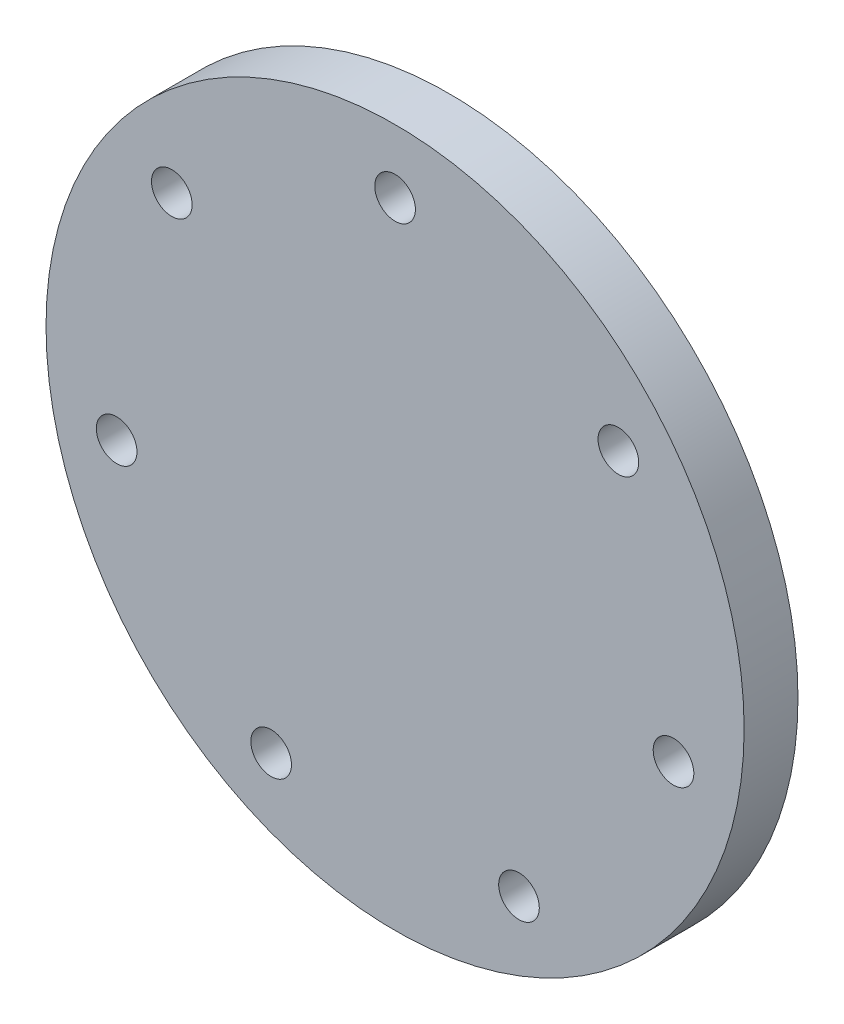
ISO-10303-21;
HEADER;
FILE_DESCRIPTION(('STEP AP214'),'2;1');
FILE_NAME('part.step','',(''),(''),'','','');
FILE_SCHEMA(('AUTOMOTIVE_DESIGN { 1 0 10303 214 1 1 1 1 }'));
ENDSEC;
DATA;
#1=APPLICATION_CONTEXT('core data for automotive mechanical design processes');
#2=APPLICATION_PROTOCOL_DEFINITION('international standard','automotive_design',2000,#1);
#3=PRODUCT_CONTEXT('',#1,'mechanical');
#4=PRODUCT('Part','Part','',(#3));
#5=PRODUCT_RELATED_PRODUCT_CATEGORY('part','',(#4));
#6=PRODUCT_DEFINITION_FORMATION('','',#4);
#7=PRODUCT_DEFINITION_CONTEXT('part definition',#1,'design');
#8=PRODUCT_DEFINITION('design','',#6,#7);
#9=PRODUCT_DEFINITION_SHAPE('','',#8);
#10=(LENGTH_UNIT() NAMED_UNIT(*) SI_UNIT(.MILLI.,.METRE.));
#11=(NAMED_UNIT(*) PLANE_ANGLE_UNIT() SI_UNIT($,.RADIAN.));
#12=(NAMED_UNIT(*) SI_UNIT($,.STERADIAN.) SOLID_ANGLE_UNIT());
#13=UNCERTAINTY_MEASURE_WITH_UNIT(LENGTH_MEASURE(1.E-05),#10,'distance_accuracy_value','');
#14=(GEOMETRIC_REPRESENTATION_CONTEXT(3) GLOBAL_UNCERTAINTY_ASSIGNED_CONTEXT((#13)) GLOBAL_UNIT_ASSIGNED_CONTEXT((#10,
#11,#12)) REPRESENTATION_CONTEXT('',''));
#15=CARTESIAN_POINT('',(0.,0.,0.));
#16=DIRECTION('',(0.,0.,1.));
#17=DIRECTION('',(1.,0.,0.));
#18=AXIS2_PLACEMENT_3D('',#15,#16,#17);
#19=CARTESIAN_POINT('',(0.,0.,10.));
#20=DIRECTION('',(0.,0.,-1.));
#21=DIRECTION('',(-1.,0.,0.));
#22=AXIS2_PLACEMENT_3D('',#19,#20,#21);
#23=CYLINDRICAL_SURFACE('',#22,64.8293956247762);
#24=CARTESIAN_POINT('',(0.,0.,10.));
#25=DIRECTION('',(0.,0.,1.));
#26=DIRECTION('',(1.,0.,0.));
#27=AXIS2_PLACEMENT_3D('',#24,#25,#26);
#28=CIRCLE('',#27,64.8293956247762);
#29=CARTESIAN_POINT('',(64.8293956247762,0.,10.));
#30=VERTEX_POINT('',#29);
#31=EDGE_CURVE('E10',#30,#30,#28,.T.);
#32=ORIENTED_EDGE('',*,*,#31,.F.);
#33=EDGE_LOOP('',(#32));
#34=FACE_BOUND('',#33,.T.);
#35=CARTESIAN_POINT('',(0.,0.,0.));
#36=DIRECTION('',(0.,0.,1.));
#37=DIRECTION('',(1.,0.,0.));
#38=AXIS2_PLACEMENT_3D('',#35,#36,#37);
#39=CIRCLE('',#38,64.8293956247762);
#40=CARTESIAN_POINT('',(64.8293956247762,0.,0.));
#41=VERTEX_POINT('',#40);
#42=EDGE_CURVE('E32',#41,#41,#39,.T.);
#43=ORIENTED_EDGE('',*,*,#42,.T.);
#44=EDGE_LOOP('',(#43));
#45=FACE_BOUND('',#44,.T.);
#46=ADVANCED_FACE('F29',(#34,#45),#23,.T.);
#47=CARTESIAN_POINT('',(0.,0.,10.));
#48=DIRECTION('',(0.,0.,1.));
#49=DIRECTION('',(1.,0.,0.));
#50=AXIS2_PLACEMENT_3D('',#47,#48,#49);
#51=PLANE('',#50);
#52=CARTESIAN_POINT('',(41.4670584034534,33.0688755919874,10.));
#53=DIRECTION('',(0.,0.,1.));
#54=DIRECTION('',(0.623489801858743,-0.781831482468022,0.));
#55=AXIS2_PLACEMENT_3D('',#52,#53,#54);
#56=CIRCLE('',#55,3.77300467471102);
#57=CARTESIAN_POINT('',(43.8194883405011,30.1190217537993,10.));
#58=VERTEX_POINT('',#57);
#59=EDGE_CURVE('E76',#58,#58,#56,.T.);
#60=ORIENTED_EDGE('',*,*,#59,.F.);
#61=EDGE_LOOP('',(#60));
#62=FACE_BOUND('',#61,.T.);
#63=CARTESIAN_POINT('',(51.708576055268,-11.8021450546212,10.));
#64=DIRECTION('',(0.,0.,1.));
#65=DIRECTION('',(-0.222520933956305,-0.974927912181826,0.));
#66=AXIS2_PLACEMENT_3D('',#63,#64,#65);
#67=CIRCLE('',#66,3.77300467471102);
#68=CARTESIAN_POINT('',(50.8690035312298,-15.4805526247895,10.));
#69=VERTEX_POINT('',#68);
#70=EDGE_CURVE('E70',#69,#69,#67,.T.);
#71=ORIENTED_EDGE('',*,*,#70,.F.);
#72=EDGE_LOOP('',(#71));
#73=FACE_BOUND('',#72,.T.);
#74=CARTESIAN_POINT('',(23.012481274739,-47.7859097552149,10.));
#75=DIRECTION('',(0.,0.,1.));
#76=DIRECTION('',(-0.900968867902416,-0.433883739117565,0.));
#77=AXIS2_PLACEMENT_3D('',#74,#75,#76);
#78=CIRCLE('',#77,3.77300467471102);
#79=CARTESIAN_POINT('',(19.6131215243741,-49.4229551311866,10.));
#80=VERTEX_POINT('',#79);
#81=EDGE_CURVE('E64',#80,#80,#78,.T.);
#82=ORIENTED_EDGE('',*,*,#81,.F.);
#83=EDGE_LOOP('',(#82));
#84=FACE_BOUND('',#83,.T.);
#85=CARTESIAN_POINT('',(-23.0124812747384,-47.7859097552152,10.));
#86=DIRECTION('',(0.,0.,1.));
#87=DIRECTION('',(-0.900968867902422,0.433883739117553,0.));
#88=AXIS2_PLACEMENT_3D('',#85,#86,#87);
#89=CIRCLE('',#88,3.77300467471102);
#90=CARTESIAN_POINT('',(-26.4118410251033,-46.1488643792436,10.));
#91=VERTEX_POINT('',#90);
#92=EDGE_CURVE('E58',#91,#91,#89,.T.);
#93=ORIENTED_EDGE('',*,*,#92,.F.);
#94=EDGE_LOOP('',(#93));
#95=FACE_BOUND('',#94,.T.);
#96=CARTESIAN_POINT('',(-51.7085760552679,-11.8021450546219,10.));
#97=DIRECTION('',(0.,0.,1.));
#98=DIRECTION('',(-0.222520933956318,0.974927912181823,0.));
#99=AXIS2_PLACEMENT_3D('',#96,#97,#98);
#100=CIRCLE('',#99,3.77300467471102);
#101=CARTESIAN_POINT('',(-52.5481485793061,-8.12373748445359,10.));
#102=VERTEX_POINT('',#101);
#103=EDGE_CURVE('E52',#102,#102,#100,.T.);
#104=ORIENTED_EDGE('',*,*,#103,.F.);
#105=EDGE_LOOP('',(#104));
#106=FACE_BOUND('',#105,.T.);
#107=CARTESIAN_POINT('',(-41.4670584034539,33.0688755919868,10.));
#108=DIRECTION('',(0.,0.,1.));
#109=DIRECTION('',(0.623489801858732,0.781831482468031,0.));
#110=AXIS2_PLACEMENT_3D('',#107,#108,#109);
#111=CIRCLE('',#110,3.77300467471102);
#112=CARTESIAN_POINT('',(-39.1146284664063,36.018729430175,10.));
#113=VERTEX_POINT('',#112);
#114=EDGE_CURVE('E44',#113,#113,#111,.T.);
#115=ORIENTED_EDGE('',*,*,#114,.F.);
#116=EDGE_LOOP('',(#115));
#117=FACE_BOUND('',#116,.T.);
#118=CARTESIAN_POINT('',(0.,53.0383584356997,10.));
#119=DIRECTION('',(0.,0.,1.));
#120=DIRECTION('',(1.,0.,0.));
#121=AXIS2_PLACEMENT_3D('',#118,#119,#120);
#122=CIRCLE('',#121,3.77300467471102);
#123=CARTESIAN_POINT('',(3.77300467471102,53.0383584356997,10.));
#124=VERTEX_POINT('',#123);
#125=EDGE_CURVE('E41',#124,#124,#122,.T.);
#126=ORIENTED_EDGE('',*,*,#125,.F.);
#127=EDGE_LOOP('',(#126));
#128=FACE_BOUND('',#127,.T.);
#129=ORIENTED_EDGE('',*,*,#31,.T.);
#130=EDGE_LOOP('',(#129));
#131=FACE_BOUND('',#130,.T.);
#132=ADVANCED_FACE('F93',(#62,#73,#84,#95,#106,#117,#128,#131),#51,.T.);
#133=CARTESIAN_POINT('',(0.,0.,0.));
#134=DIRECTION('',(0.,0.,1.));
#135=DIRECTION('',(1.,0.,0.));
#136=AXIS2_PLACEMENT_3D('',#133,#134,#135);
#137=PLANE('',#136);
#138=CARTESIAN_POINT('',(41.4670584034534,33.0688755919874,0.));
#139=DIRECTION('',(0.,0.,1.));
#140=DIRECTION('',(0.623489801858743,-0.781831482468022,0.));
#141=AXIS2_PLACEMENT_3D('',#138,#139,#140);
#142=CIRCLE('',#141,3.77300467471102);
#143=CARTESIAN_POINT('',(43.8194883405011,30.1190217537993,0.));
#144=VERTEX_POINT('',#143);
#145=EDGE_CURVE('E79',#144,#144,#142,.T.);
#146=ORIENTED_EDGE('',*,*,#145,.T.);
#147=EDGE_LOOP('',(#146));
#148=FACE_BOUND('',#147,.T.);
#149=CARTESIAN_POINT('',(51.708576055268,-11.8021450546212,0.));
#150=DIRECTION('',(0.,0.,1.));
#151=DIRECTION('',(-0.222520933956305,-0.974927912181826,0.));
#152=AXIS2_PLACEMENT_3D('',#149,#150,#151);
#153=CIRCLE('',#152,3.77300467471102);
#154=CARTESIAN_POINT('',(50.8690035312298,-15.4805526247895,0.));
#155=VERTEX_POINT('',#154);
#156=EDGE_CURVE('E73',#155,#155,#153,.T.);
#157=ORIENTED_EDGE('',*,*,#156,.T.);
#158=EDGE_LOOP('',(#157));
#159=FACE_BOUND('',#158,.T.);
#160=CARTESIAN_POINT('',(23.012481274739,-47.7859097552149,0.));
#161=DIRECTION('',(0.,0.,1.));
#162=DIRECTION('',(-0.900968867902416,-0.433883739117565,0.));
#163=AXIS2_PLACEMENT_3D('',#160,#161,#162);
#164=CIRCLE('',#163,3.77300467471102);
#165=CARTESIAN_POINT('',(19.6131215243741,-49.4229551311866,0.));
#166=VERTEX_POINT('',#165);
#167=EDGE_CURVE('E67',#166,#166,#164,.T.);
#168=ORIENTED_EDGE('',*,*,#167,.T.);
#169=EDGE_LOOP('',(#168));
#170=FACE_BOUND('',#169,.T.);
#171=CARTESIAN_POINT('',(-23.0124812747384,-47.7859097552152,0.));
#172=DIRECTION('',(0.,0.,1.));
#173=DIRECTION('',(-0.900968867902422,0.433883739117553,0.));
#174=AXIS2_PLACEMENT_3D('',#171,#172,#173);
#175=CIRCLE('',#174,3.77300467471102);
#176=CARTESIAN_POINT('',(-26.4118410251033,-46.1488643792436,0.));
#177=VERTEX_POINT('',#176);
#178=EDGE_CURVE('E61',#177,#177,#175,.T.);
#179=ORIENTED_EDGE('',*,*,#178,.T.);
#180=EDGE_LOOP('',(#179));
#181=FACE_BOUND('',#180,.T.);
#182=CARTESIAN_POINT('',(-51.7085760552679,-11.8021450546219,0.));
#183=DIRECTION('',(0.,0.,1.));
#184=DIRECTION('',(-0.222520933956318,0.974927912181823,0.));
#185=AXIS2_PLACEMENT_3D('',#182,#183,#184);
#186=CIRCLE('',#185,3.77300467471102);
#187=CARTESIAN_POINT('',(-52.5481485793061,-8.12373748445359,0.));
#188=VERTEX_POINT('',#187);
#189=EDGE_CURVE('E55',#188,#188,#186,.T.);
#190=ORIENTED_EDGE('',*,*,#189,.T.);
#191=EDGE_LOOP('',(#190));
#192=FACE_BOUND('',#191,.T.);
#193=CARTESIAN_POINT('',(-41.4670584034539,33.0688755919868,0.));
#194=DIRECTION('',(0.,0.,1.));
#195=DIRECTION('',(0.623489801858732,0.781831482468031,0.));
#196=AXIS2_PLACEMENT_3D('',#193,#194,#195);
#197=CIRCLE('',#196,3.77300467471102);
#198=CARTESIAN_POINT('',(-39.1146284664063,36.018729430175,0.));
#199=VERTEX_POINT('',#198);
#200=EDGE_CURVE('E49',#199,#199,#197,.T.);
#201=ORIENTED_EDGE('',*,*,#200,.T.);
#202=EDGE_LOOP('',(#201));
#203=FACE_BOUND('',#202,.T.);
#204=CARTESIAN_POINT('',(0.,53.0383584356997,0.));
#205=DIRECTION('',(0.,0.,1.));
#206=DIRECTION('',(1.,0.,0.));
#207=AXIS2_PLACEMENT_3D('',#204,#205,#206);
#208=CIRCLE('',#207,3.77300467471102);
#209=CARTESIAN_POINT('',(3.77300467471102,53.0383584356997,0.));
#210=VERTEX_POINT('',#209);
#211=EDGE_CURVE('E39',#210,#210,#208,.T.);
#212=ORIENTED_EDGE('',*,*,#211,.T.);
#213=EDGE_LOOP('',(#212));
#214=FACE_BOUND('',#213,.T.);
#215=ORIENTED_EDGE('',*,*,#42,.F.);
#216=EDGE_LOOP('',(#215));
#217=FACE_BOUND('',#216,.T.);
#218=ADVANCED_FACE('F83',(#148,#159,#170,#181,#192,#203,#214,#217),#137,.F.);
#219=CARTESIAN_POINT('',(0.,53.0383584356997,0.));
#220=DIRECTION('',(0.,0.,1.));
#221=DIRECTION('',(1.,0.,0.));
#222=AXIS2_PLACEMENT_3D('',#219,#220,#221);
#223=CYLINDRICAL_SURFACE('',#222,3.77300467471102);
#224=ORIENTED_EDGE('',*,*,#211,.F.);
#225=EDGE_LOOP('',(#224));
#226=FACE_BOUND('',#225,.T.);
#227=ORIENTED_EDGE('',*,*,#125,.T.);
#228=EDGE_LOOP('',(#227));
#229=FACE_BOUND('',#228,.T.);
#230=ADVANCED_FACE('F109',(#226,#229),#223,.F.);
#231=CARTESIAN_POINT('',(-41.4670584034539,33.0688755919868,0.));
#232=DIRECTION('',(0.,0.,1.));
#233=DIRECTION('',(0.623489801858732,0.781831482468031,0.));
#234=AXIS2_PLACEMENT_3D('',#231,#232,#233);
#235=CYLINDRICAL_SURFACE('',#234,3.77300467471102);
#236=ORIENTED_EDGE('',*,*,#200,.F.);
#237=EDGE_LOOP('',(#236));
#238=FACE_BOUND('',#237,.T.);
#239=ORIENTED_EDGE('',*,*,#114,.T.);
#240=EDGE_LOOP('',(#239));
#241=FACE_BOUND('',#240,.T.);
#242=ADVANCED_FACE('F111',(#238,#241),#235,.F.);
#243=CARTESIAN_POINT('',(-51.7085760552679,-11.8021450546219,0.));
#244=DIRECTION('',(0.,0.,1.));
#245=DIRECTION('',(-0.222520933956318,0.974927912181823,0.));
#246=AXIS2_PLACEMENT_3D('',#243,#244,#245);
#247=CYLINDRICAL_SURFACE('',#246,3.77300467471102);
#248=ORIENTED_EDGE('',*,*,#189,.F.);
#249=EDGE_LOOP('',(#248));
#250=FACE_BOUND('',#249,.T.);
#251=ORIENTED_EDGE('',*,*,#103,.T.);
#252=EDGE_LOOP('',(#251));
#253=FACE_BOUND('',#252,.T.);
#254=ADVANCED_FACE('F118',(#250,#253),#247,.F.);
#255=CARTESIAN_POINT('',(-23.0124812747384,-47.7859097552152,0.));
#256=DIRECTION('',(0.,0.,1.));
#257=DIRECTION('',(-0.900968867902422,0.433883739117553,0.));
#258=AXIS2_PLACEMENT_3D('',#255,#256,#257);
#259=CYLINDRICAL_SURFACE('',#258,3.77300467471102);
#260=ORIENTED_EDGE('',*,*,#178,.F.);
#261=EDGE_LOOP('',(#260));
#262=FACE_BOUND('',#261,.T.);
#263=ORIENTED_EDGE('',*,*,#92,.T.);
#264=EDGE_LOOP('',(#263));
#265=FACE_BOUND('',#264,.T.);
#266=ADVANCED_FACE('F153',(#262,#265),#259,.F.);
#267=CARTESIAN_POINT('',(23.012481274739,-47.7859097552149,0.));
#268=DIRECTION('',(0.,0.,1.));
#269=DIRECTION('',(-0.900968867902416,-0.433883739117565,0.));
#270=AXIS2_PLACEMENT_3D('',#267,#268,#269);
#271=CYLINDRICAL_SURFACE('',#270,3.77300467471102);
#272=ORIENTED_EDGE('',*,*,#167,.F.);
#273=EDGE_LOOP('',(#272));
#274=FACE_BOUND('',#273,.T.);
#275=ORIENTED_EDGE('',*,*,#81,.T.);
#276=EDGE_LOOP('',(#275));
#277=FACE_BOUND('',#276,.T.);
#278=ADVANCED_FACE('F163',(#274,#277),#271,.F.);
#279=CARTESIAN_POINT('',(51.708576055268,-11.8021450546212,0.));
#280=DIRECTION('',(0.,0.,1.));
#281=DIRECTION('',(-0.222520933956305,-0.974927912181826,0.));
#282=AXIS2_PLACEMENT_3D('',#279,#280,#281);
#283=CYLINDRICAL_SURFACE('',#282,3.77300467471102);
#284=ORIENTED_EDGE('',*,*,#156,.F.);
#285=EDGE_LOOP('',(#284));
#286=FACE_BOUND('',#285,.T.);
#287=ORIENTED_EDGE('',*,*,#70,.T.);
#288=EDGE_LOOP('',(#287));
#289=FACE_BOUND('',#288,.T.);
#290=ADVANCED_FACE('F89',(#286,#289),#283,.F.);
#291=CARTESIAN_POINT('',(41.4670584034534,33.0688755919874,0.));
#292=DIRECTION('',(0.,0.,1.));
#293=DIRECTION('',(0.623489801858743,-0.781831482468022,0.));
#294=AXIS2_PLACEMENT_3D('',#291,#292,#293);
#295=CYLINDRICAL_SURFACE('',#294,3.77300467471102);
#296=ORIENTED_EDGE('',*,*,#145,.F.);
#297=EDGE_LOOP('',(#296));
#298=FACE_BOUND('',#297,.T.);
#299=ORIENTED_EDGE('',*,*,#59,.T.);
#300=EDGE_LOOP('',(#299));
#301=FACE_BOUND('',#300,.T.);
#302=ADVANCED_FACE('F86',(#298,#301),#295,.F.);
#303=CLOSED_SHELL('',(#46,#132,#218,#230,#242,#254,#266,#278,#290,#302));
#304=MANIFOLD_SOLID_BREP('B2',#303);
#305=ADVANCED_BREP_SHAPE_REPRESENTATION('',(#18,#304),#14);
#306=SHAPE_DEFINITION_REPRESENTATION(#9,#305);
ENDSEC;
END-ISO-10303-21;
